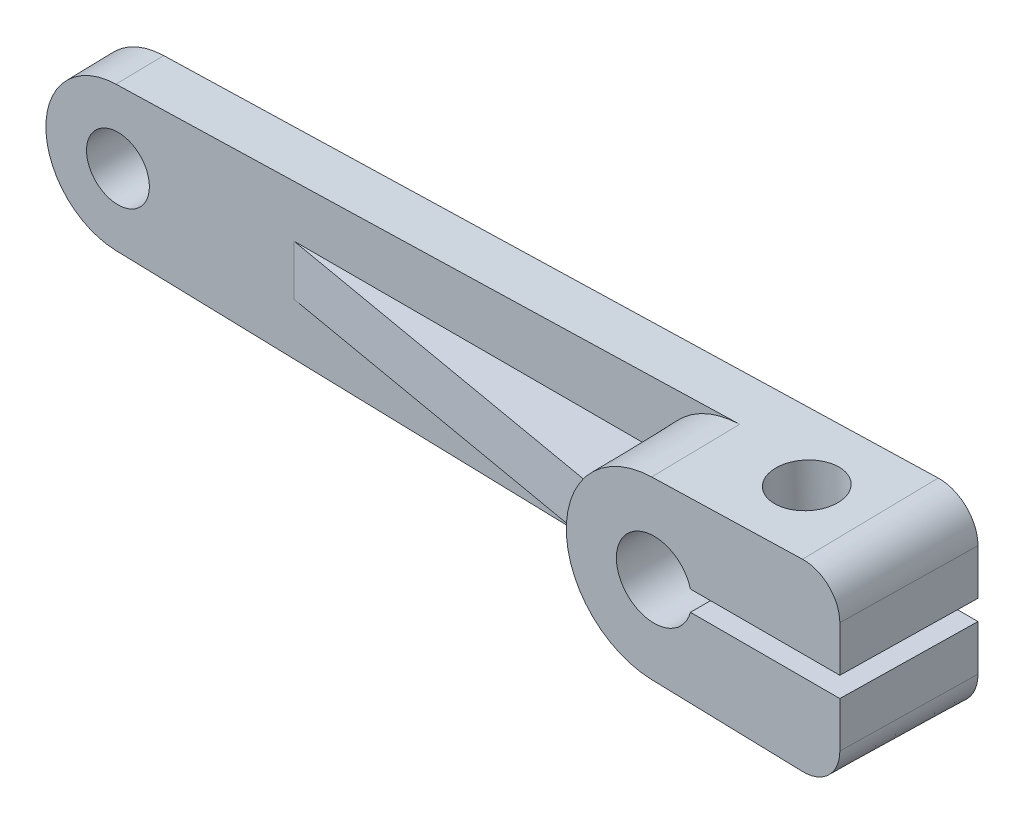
ISO-10303-21;
HEADER;
FILE_DESCRIPTION(('STEP AP214'),'2;1');
FILE_NAME('part.step','',(''),(''),'','','');
FILE_SCHEMA(('AUTOMOTIVE_DESIGN { 1 0 10303 214 1 1 1 1 }'));
ENDSEC;
DATA;
#1=APPLICATION_CONTEXT('core data for automotive mechanical design processes');
#2=APPLICATION_PROTOCOL_DEFINITION('international standard','automotive_design',2000,#1);
#3=PRODUCT_CONTEXT('',#1,'mechanical');
#4=PRODUCT('Part','Part','',(#3));
#5=PRODUCT_RELATED_PRODUCT_CATEGORY('part','',(#4));
#6=PRODUCT_DEFINITION_FORMATION('','',#4);
#7=PRODUCT_DEFINITION_CONTEXT('part definition',#1,'design');
#8=PRODUCT_DEFINITION('design','',#6,#7);
#9=PRODUCT_DEFINITION_SHAPE('','',#8);
#10=(LENGTH_UNIT() NAMED_UNIT(*) SI_UNIT(.MILLI.,.METRE.));
#11=(NAMED_UNIT(*) PLANE_ANGLE_UNIT() SI_UNIT($,.RADIAN.));
#12=(NAMED_UNIT(*) SI_UNIT($,.STERADIAN.) SOLID_ANGLE_UNIT());
#13=UNCERTAINTY_MEASURE_WITH_UNIT(LENGTH_MEASURE(1.E-05),#10,'distance_accuracy_value','');
#14=(GEOMETRIC_REPRESENTATION_CONTEXT(3) GLOBAL_UNCERTAINTY_ASSIGNED_CONTEXT((#13)) GLOBAL_UNIT_ASSIGNED_CONTEXT((#10,
#11,#12)) REPRESENTATION_CONTEXT('',''));
#15=CARTESIAN_POINT('',(0.,0.,0.));
#16=DIRECTION('',(0.,0.,1.));
#17=DIRECTION('',(1.,0.,0.));
#18=AXIS2_PLACEMENT_3D('',#15,#16,#17);
#19=CARTESIAN_POINT('',(32.3,2.21134072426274,0.));
#20=DIRECTION('',(0.999847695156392,0.,0.0174524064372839));
#21=DIRECTION('',(0.0174524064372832,0.,-0.999847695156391));
#22=AXIS2_PLACEMENT_3D('',#19,#20,#21);
#23=PLANE('',#22);
#24=DIRECTION('',(0.0174524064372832,0.,-0.999847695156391));
#25=VECTOR('',#24,1.);
#26=CARTESIAN_POINT('',(32.3,2.21134072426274,0.));
#27=LINE('',#26,#25);
#28=CARTESIAN_POINT('',(32.2057426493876,2.21134072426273,5.40000000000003));
#29=VERTEX_POINT('',#28);
#30=CARTESIAN_POINT('',(32.3,2.21134072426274,0.));
#31=VERTEX_POINT('',#30);
#32=EDGE_CURVE('E271',#29,#31,#27,.T.);
#33=ORIENTED_EDGE('',*,*,#32,.F.);
#34=DIRECTION('',(0.,-1.,0.));
#35=VECTOR('',#34,1.);
#36=CARTESIAN_POINT('',(32.2057426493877,-2.21134072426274,5.40000000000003));
#37=LINE('',#36,#35);
#38=CARTESIAN_POINT('',(32.2057426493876,0.400000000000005,5.4));
#39=VERTEX_POINT('',#38);
#40=EDGE_CURVE('E297',#39,#29,#37,.F.);
#41=ORIENTED_EDGE('',*,*,#40,.F.);
#42=DIRECTION('',(0.0174524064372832,0.,-0.999847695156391));
#43=VECTOR('',#42,1.);
#44=CARTESIAN_POINT('',(32.3,0.399999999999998,0.));
#45=LINE('',#44,#43);
#46=CARTESIAN_POINT('',(32.3,0.399999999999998,0.));
#47=VERTEX_POINT('',#46);
#48=EDGE_CURVE('E214',#39,#47,#45,.T.);
#49=ORIENTED_EDGE('',*,*,#48,.T.);
#50=DIRECTION('',(0.,-1.,0.));
#51=VECTOR('',#50,1.);
#52=CARTESIAN_POINT('',(32.3,2.21134072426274,0.));
#53=LINE('',#52,#51);
#54=EDGE_CURVE('E281',#31,#47,#53,.T.);
#55=ORIENTED_EDGE('',*,*,#54,.F.);
#56=EDGE_LOOP('',(#33,#41,#49,#55));
#57=FACE_BOUND('',#56,.T.);
#58=ADVANCED_FACE('F30',(#57),#23,.T.);
#59=CARTESIAN_POINT('',(0.,0.,0.));
#60=DIRECTION('',(0.,0.,1.));
#61=DIRECTION('',(1.,0.,0.));
#62=AXIS2_PLACEMENT_3D('',#59,#60,#61);
#63=PLANE('',#62);
#64=CARTESIAN_POINT('',(0.,0.,0.));
#65=DIRECTION('',(0.,0.,1.));
#66=DIRECTION('',(1.,0.,0.));
#67=AXIS2_PLACEMENT_3D('',#64,#65,#66);
#68=CIRCLE('',#67,1.25);
#69=CARTESIAN_POINT('',(1.25,0.,0.));
#70=VERTEX_POINT('',#69);
#71=EDGE_CURVE('E217',#70,#70,#68,.T.);
#72=ORIENTED_EDGE('',*,*,#71,.T.);
#73=EDGE_LOOP('',(#72));
#74=FACE_BOUND('',#73,.T.);
#75=ORIENTED_EDGE('',*,*,#54,.T.);
#76=DIRECTION('',(1.,0.,0.));
#77=VECTOR('',#76,1.);
#78=CARTESIAN_POINT('',(26.2649687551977,0.399999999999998,0.));
#79=LINE('',#78,#77);
#80=CARTESIAN_POINT('',(26.2649687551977,0.399999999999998,0.));
#81=VERTEX_POINT('',#80);
#82=EDGE_CURVE('E205',#81,#47,#79,.T.);
#83=ORIENTED_EDGE('',*,*,#82,.F.);
#84=CARTESIAN_POINT('',(24.8192855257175,0.,0.));
#85=DIRECTION('',(0.,0.,1.));
#86=DIRECTION('',(1.,0.,0.));
#87=AXIS2_PLACEMENT_3D('',#84,#85,#86);
#88=CIRCLE('',#87,1.5);
#89=CARTESIAN_POINT('',(26.2649687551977,-0.399999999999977,0.));
#90=VERTEX_POINT('',#89);
#91=EDGE_CURVE('E200',#81,#90,#88,.T.);
#92=ORIENTED_EDGE('',*,*,#91,.T.);
#93=DIRECTION('',(1.,0.,0.));
#94=VECTOR('',#93,1.);
#95=CARTESIAN_POINT('',(26.2649687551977,-0.399999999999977,0.));
#96=LINE('',#95,#94);
#97=CARTESIAN_POINT('',(32.3,-0.399999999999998,0.));
#98=VERTEX_POINT('',#97);
#99=EDGE_CURVE('E202',#90,#98,#96,.T.);
#100=ORIENTED_EDGE('',*,*,#99,.T.);
#101=CARTESIAN_POINT('',(32.3,-2.21134072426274,0.));
#102=VERTEX_POINT('',#101);
#103=EDGE_CURVE('E283',#98,#102,#53,.T.);
#104=ORIENTED_EDGE('',*,*,#103,.T.);
#105=CARTESIAN_POINT('',(30.7607533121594,-2.21134072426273,0.));
#106=DIRECTION('',(0.,0.,1.));
#107=DIRECTION('',(1.,0.,0.));
#108=AXIS2_PLACEMENT_3D('',#105,#106,#107);
#109=CIRCLE('',#108,1.53924668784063);
#110=CARTESIAN_POINT('',(30.7182327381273,-3.75,0.));
#111=VERTEX_POINT('',#110);
#112=EDGE_CURVE('E284',#111,#102,#109,.T.);
#113=ORIENTED_EDGE('',*,*,#112,.F.);
#114=DIRECTION('',(0.999618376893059,-0.0276242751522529,0.));
#115=VECTOR('',#114,1.);
#116=CARTESIAN_POINT('',(-0.0801103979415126,-2.89889329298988,0.));
#117=LINE('',#116,#115);
#118=CARTESIAN_POINT('',(-0.0801103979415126,-2.89889329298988,0.));
#119=VERTEX_POINT('',#118);
#120=EDGE_CURVE('E240',#119,#111,#117,.T.);
#121=ORIENTED_EDGE('',*,*,#120,.F.);
#122=CARTESIAN_POINT('',(0.,0.,0.));
#123=DIRECTION('',(0.,0.,1.));
#124=DIRECTION('',(1.,0.,0.));
#125=AXIS2_PLACEMENT_3D('',#122,#123,#124);
#126=CIRCLE('',#125,2.9);
#127=CARTESIAN_POINT('',(-0.0801103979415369,2.89889329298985,0.));
#128=VERTEX_POINT('',#127);
#129=EDGE_CURVE('E237',#128,#119,#126,.T.);
#130=ORIENTED_EDGE('',*,*,#129,.F.);
#131=DIRECTION('',(0.999618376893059,0.027624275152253,0.));
#132=VECTOR('',#131,1.);
#133=CARTESIAN_POINT('',(-0.0801103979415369,2.89889329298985,0.));
#134=LINE('',#133,#132);
#135=CARTESIAN_POINT('',(30.7182327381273,3.75,0.));
#136=VERTEX_POINT('',#135);
#137=EDGE_CURVE('E266',#128,#136,#134,.T.);
#138=ORIENTED_EDGE('',*,*,#137,.T.);
#139=CARTESIAN_POINT('',(30.7607533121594,2.21134072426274,0.));
#140=DIRECTION('',(0.,0.,-1.));
#141=DIRECTION('',(-1.,0.,0.));
#142=AXIS2_PLACEMENT_3D('',#139,#140,#141);
#143=CIRCLE('',#142,1.53924668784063);
#144=EDGE_CURVE('E278',#136,#31,#143,.T.);
#145=ORIENTED_EDGE('',*,*,#144,.T.);
#146=EDGE_LOOP('',(#75,#83,#92,#100,#104,#113,#121,#130,#138,#145));
#147=FACE_BOUND('',#146,.T.);
#148=ADVANCED_FACE('F328',(#74,#147),#63,.F.);
#149=CARTESIAN_POINT('',(30.7607533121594,-2.21134072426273,5.40000000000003));
#150=DIRECTION('',(0.,0.,1.));
#151=DIRECTION('',(1.,0.,0.));
#152=AXIS2_PLACEMENT_3D('',#149,#150,#151);
#153=PLANE('',#152);
#154=DIRECTION('',(1.,0.,0.));
#155=VECTOR('',#154,1.);
#156=CARTESIAN_POINT('',(26.2649687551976,0.400000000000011,5.4));
#157=LINE('',#156,#155);
#158=CARTESIAN_POINT('',(26.2649687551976,0.400000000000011,5.4));
#159=VERTEX_POINT('',#158);
#160=EDGE_CURVE('E198',#159,#39,#157,.T.);
#161=ORIENTED_EDGE('',*,*,#160,.T.);
#162=ORIENTED_EDGE('',*,*,#40,.T.);
#163=CARTESIAN_POINT('',(30.7607533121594,2.21134072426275,5.4));
#164=DIRECTION('',(0.,0.,1.));
#165=DIRECTION('',(1.,0.,0.));
#166=AXIS2_PLACEMENT_3D('',#163,#164,#165);
#167=CIRCLE('',#166,1.44498933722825);
#168=CARTESIAN_POINT('',(30.7208365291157,3.65577862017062,5.40000000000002));
#169=VERTEX_POINT('',#168);
#170=EDGE_CURVE('E294',#29,#169,#167,.T.);
#171=ORIENTED_EDGE('',*,*,#170,.T.);
#172=DIRECTION('',(0.999618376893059,0.0276242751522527,0.));
#173=VECTOR('',#172,1.);
#174=CARTESIAN_POINT('',(30.7208365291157,3.65577862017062,5.40000000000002));
#175=LINE('',#174,#173);
#176=CARTESIAN_POINT('',(24.722839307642,3.49002503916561,5.4));
#177=VERTEX_POINT('',#176);
#178=EDGE_CURVE('E291',#169,#177,#175,.F.);
#179=ORIENTED_EDGE('',*,*,#178,.T.);
#180=CARTESIAN_POINT('',(24.8192855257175,0.,5.4));
#181=DIRECTION('',(0.,0.,1.));
#182=DIRECTION('',(1.,0.,0.));
#183=AXIS2_PLACEMENT_3D('',#180,#181,#182);
#184=CIRCLE('',#183,3.49135742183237);
#185=CARTESIAN_POINT('',(24.722839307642,-3.49002503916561,5.40000000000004));
#186=VERTEX_POINT('',#185);
#187=EDGE_CURVE('E249',#177,#186,#184,.T.);
#188=ORIENTED_EDGE('',*,*,#187,.T.);
#189=DIRECTION('',(-0.999618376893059,0.0276242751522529,0.));
#190=VECTOR('',#189,1.);
#191=CARTESIAN_POINT('',(24.722839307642,-3.49002503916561,5.40000000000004));
#192=LINE('',#191,#190);
#193=CARTESIAN_POINT('',(30.7208365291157,-3.65577862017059,5.40000000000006));
#194=VERTEX_POINT('',#193);
#195=EDGE_CURVE('E243',#186,#194,#192,.F.);
#196=ORIENTED_EDGE('',*,*,#195,.T.);
#197=CARTESIAN_POINT('',(30.7607533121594,-2.21134072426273,5.40000000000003));
#198=DIRECTION('',(0.,0.,1.));
#199=DIRECTION('',(1.,0.,0.));
#200=AXIS2_PLACEMENT_3D('',#197,#198,#199);
#201=CIRCLE('',#200,1.44498933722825);
#202=CARTESIAN_POINT('',(32.2057426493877,-2.21134072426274,5.40000000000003));
#203=VERTEX_POINT('',#202);
#204=EDGE_CURVE('E226',#194,#203,#201,.T.);
#205=ORIENTED_EDGE('',*,*,#204,.T.);
#206=CARTESIAN_POINT('',(32.2057426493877,-0.399999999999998,5.40000000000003));
#207=VERTEX_POINT('',#206);
#208=EDGE_CURVE('E296',#203,#207,#37,.F.);
#209=ORIENTED_EDGE('',*,*,#208,.T.);
#210=DIRECTION('',(1.,0.,0.));
#211=VECTOR('',#210,1.);
#212=CARTESIAN_POINT('',(26.2649687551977,-0.400000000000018,5.40000000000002));
#213=LINE('',#212,#211);
#214=CARTESIAN_POINT('',(26.2649687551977,-0.400000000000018,5.40000000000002));
#215=VERTEX_POINT('',#214);
#216=EDGE_CURVE('E195',#215,#207,#213,.T.);
#217=ORIENTED_EDGE('',*,*,#216,.F.);
#218=CARTESIAN_POINT('',(24.8192855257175,0.,5.4));
#219=DIRECTION('',(0.,0.,1.));
#220=DIRECTION('',(1.,0.,0.));
#221=AXIS2_PLACEMENT_3D('',#218,#219,#220);
#222=CIRCLE('',#221,1.5);
#223=EDGE_CURVE('E192',#159,#215,#222,.T.);
#224=ORIENTED_EDGE('',*,*,#223,.F.);
#225=EDGE_LOOP('',(#161,#162,#171,#179,#188,#196,#205,#209,#217,#224));
#226=FACE_BOUND('',#225,.T.);
#227=ADVANCED_FACE('F335',(#226),#153,.T.);
#228=CARTESIAN_POINT('',(0.,0.,0.));
#229=DIRECTION('',(0.,0.,-1.));
#230=DIRECTION('',(1.,0.,0.));
#231=AXIS2_PLACEMENT_3D('',#228,#229,#230);
#232=CONICAL_SURFACE('',#231,2.9,0.0174532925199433);
#233=ORIENTED_EDGE('',*,*,#129,.T.);
#234=DIRECTION('',(-0.000482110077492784,-0.0174457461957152,-0.999847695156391));
#235=VECTOR('',#234,1.);
#236=CARTESIAN_POINT('',(-0.0801103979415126,-2.89889329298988,0.));
#237=LINE('',#236,#235);
#238=CARTESIAN_POINT('',(-0.0791942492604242,-2.86574132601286,1.9));
#239=VERTEX_POINT('',#238);
#240=EDGE_CURVE('E11',#239,#119,#237,.T.);
#241=ORIENTED_EDGE('',*,*,#240,.F.);
#242=CARTESIAN_POINT('',(0.,0.,1.90000000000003));
#243=DIRECTION('',(0.,0.,1.));
#244=DIRECTION('',(1.,0.,0.));
#245=AXIS2_PLACEMENT_3D('',#242,#243,#244);
#246=CIRCLE('',#245,2.86683537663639);
#247=CARTESIAN_POINT('',(-0.079194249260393,2.86574132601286,1.9));
#248=VERTEX_POINT('',#247);
#249=EDGE_CURVE('E263',#248,#239,#246,.T.);
#250=ORIENTED_EDGE('',*,*,#249,.F.);
#251=DIRECTION('',(-0.000482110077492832,0.0174457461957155,-0.999847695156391));
#252=VECTOR('',#251,1.);
#253=CARTESIAN_POINT('',(-0.0801103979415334,2.89889329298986,0.));
#254=LINE('',#253,#252);
#255=EDGE_CURVE('E257',#248,#128,#254,.T.);
#256=ORIENTED_EDGE('',*,*,#255,.T.);
#257=EDGE_LOOP('',(#233,#241,#250,#256));
#258=FACE_BOUND('',#257,.T.);
#259=ADVANCED_FACE('F361',(#258),#232,.T.);
#260=CARTESIAN_POINT('',(-0.0801103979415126,-2.89889329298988,0.));
#261=DIRECTION('',(-0.0276200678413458,-0.999466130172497,0.0174524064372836));
#262=DIRECTION('',(0.999618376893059,-0.0276242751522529,0.));
#263=AXIS2_PLACEMENT_3D('',#260,#261,#262);
#264=PLANE('',#263);
#265=CARTESIAN_POINT('',(28.4409052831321,-3.6412721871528,2.62255109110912));
#266=DIRECTION('',(-0.0276200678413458,-0.999466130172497,0.0174524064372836));
#267=DIRECTION('',(-0.844924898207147,0.0326719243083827,0.53388618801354));
#268=AXIS2_PLACEMENT_3D('',#265,#266,#267);
#269=ELLIPSE('',#268,1.25267434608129,1.25);
#270=CARTESIAN_POINT('',(27.3824895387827,-3.60034490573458,3.29133662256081));
#271=VERTEX_POINT('',#270);
#272=EDGE_CURVE('E156',#271,#271,#269,.F.);
#273=ORIENTED_EDGE('',*,*,#272,.T.);
#274=EDGE_LOOP('',(#273));
#275=FACE_BOUND('',#274,.T.);
#276=DIRECTION('',(-0.00048211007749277,-0.0174457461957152,-0.999847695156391));
#277=VECTOR('',#276,1.);
#278=CARTESIAN_POINT('',(30.7182327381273,-3.75,0.));
#279=LINE('',#278,#277);
#280=EDGE_CURVE('E39',#194,#111,#279,.T.);
#281=ORIENTED_EDGE('',*,*,#280,.F.);
#282=ORIENTED_EDGE('',*,*,#195,.F.);
#283=DIRECTION('',(-0.000482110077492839,-0.0174457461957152,-0.999847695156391));
#284=VECTOR('',#283,1.);
#285=CARTESIAN_POINT('',(24.7211516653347,-3.55109445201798,1.90000000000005));
#286=LINE('',#285,#284);
#287=CARTESIAN_POINT('',(24.7211516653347,-3.55109445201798,1.90000000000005));
#288=VERTEX_POINT('',#287);
#289=EDGE_CURVE('E238',#186,#288,#286,.T.);
#290=ORIENTED_EDGE('',*,*,#289,.T.);
#291=DIRECTION('',(-0.999618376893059,0.0276242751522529,0.));
#292=VECTOR('',#291,1.);
#293=CARTESIAN_POINT('',(-0.0791942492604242,-2.86574132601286,1.9));
#294=LINE('',#293,#292);
#295=EDGE_CURVE('E258',#239,#288,#294,.F.);
#296=ORIENTED_EDGE('',*,*,#295,.F.);
#297=ORIENTED_EDGE('',*,*,#240,.T.);
#298=ORIENTED_EDGE('',*,*,#120,.T.);
#299=EDGE_LOOP('',(#281,#282,#290,#296,#297,#298));
#300=FACE_BOUND('',#299,.T.);
#301=ADVANCED_FACE('F32',(#275,#300),#264,.T.);
#302=CARTESIAN_POINT('',(30.7607533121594,-2.21134072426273,0.));
#303=DIRECTION('',(0.,0.,-1.));
#304=DIRECTION('',(1.,0.,0.));
#305=AXIS2_PLACEMENT_3D('',#302,#303,#304);
#306=CONICAL_SURFACE('',#305,1.53924668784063,0.0174532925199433);
#307=DIRECTION('',(0.0174524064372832,0.,-0.999847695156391));
#308=VECTOR('',#307,1.);
#309=CARTESIAN_POINT('',(32.3,-2.21134072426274,0.));
#310=LINE('',#309,#308);
#311=EDGE_CURVE('E268',#203,#102,#310,.T.);
#312=ORIENTED_EDGE('',*,*,#311,.F.);
#313=ORIENTED_EDGE('',*,*,#204,.F.);
#314=ORIENTED_EDGE('',*,*,#280,.T.);
#315=ORIENTED_EDGE('',*,*,#112,.T.);
#316=EDGE_LOOP('',(#312,#313,#314,#315));
#317=FACE_BOUND('',#316,.T.);
#318=ADVANCED_FACE('F339',(#317),#306,.T.);
#319=DIRECTION('',(0.0174524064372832,0.,-0.999847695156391));
#320=VECTOR('',#319,1.);
#321=CARTESIAN_POINT('',(32.3,-0.399999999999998,0.));
#322=LINE('',#321,#320);
#323=EDGE_CURVE('E212',#207,#98,#322,.T.);
#324=ORIENTED_EDGE('',*,*,#323,.F.);
#325=ORIENTED_EDGE('',*,*,#208,.F.);
#326=ORIENTED_EDGE('',*,*,#311,.T.);
#327=ORIENTED_EDGE('',*,*,#103,.F.);
#328=EDGE_LOOP('',(#324,#325,#326,#327));
#329=FACE_BOUND('',#328,.T.);
#330=ADVANCED_FACE('F331',(#329),#23,.T.);
#331=CARTESIAN_POINT('',(30.7607533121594,2.21134072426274,0.));
#332=DIRECTION('',(0.,0.,-1.));
#333=DIRECTION('',(-1.,0.,0.));
#334=AXIS2_PLACEMENT_3D('',#331,#332,#333);
#335=CONICAL_SURFACE('',#334,1.53924668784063,0.0174532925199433);
#336=DIRECTION('',(-0.000482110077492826,0.0174457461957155,-0.999847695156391));
#337=VECTOR('',#336,1.);
#338=CARTESIAN_POINT('',(30.7182327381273,3.75,0.));
#339=LINE('',#338,#337);
#340=EDGE_CURVE('E273',#169,#136,#339,.T.);
#341=ORIENTED_EDGE('',*,*,#340,.F.);
#342=ORIENTED_EDGE('',*,*,#170,.F.);
#343=ORIENTED_EDGE('',*,*,#32,.T.);
#344=ORIENTED_EDGE('',*,*,#144,.F.);
#345=EDGE_LOOP('',(#341,#342,#343,#344));
#346=FACE_BOUND('',#345,.T.);
#347=ADVANCED_FACE('F311',(#346),#335,.T.);
#348=CARTESIAN_POINT('',(-0.0801103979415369,2.89889329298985,0.));
#349=DIRECTION('',(-0.0276200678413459,0.999466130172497,0.0174524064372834));
#350=DIRECTION('',(-0.999618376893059,-0.027624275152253,0.));
#351=AXIS2_PLACEMENT_3D('',#348,#349,#350);
#352=PLANE('',#351);
#353=CARTESIAN_POINT('',(28.2398682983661,3.63349840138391,2.7495811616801));
#354=DIRECTION('',(-0.0276200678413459,0.999466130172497,0.0174524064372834));
#355=DIRECTION('',(-0.999618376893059,-0.027624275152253,0.));
#356=AXIS2_PLACEMENT_3D('',#353,#354,#355);
#357=CIRCLE('',#356,1.25);
#358=CARTESIAN_POINT('',(26.9903453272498,3.59896805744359,2.7495811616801));
#359=VERTEX_POINT('',#358);
#360=EDGE_CURVE('E379',#359,#359,#357,.T.);
#361=ORIENTED_EDGE('',*,*,#360,.F.);
#362=EDGE_LOOP('',(#361));
#363=FACE_BOUND('',#362,.T.);
#364=DIRECTION('',(0.999618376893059,0.027624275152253,0.));
#365=VECTOR('',#364,1.);
#366=CARTESIAN_POINT('',(-0.079194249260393,2.86574132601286,1.9));
#367=LINE('',#366,#365);
#368=CARTESIAN_POINT('',(24.7211516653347,3.551094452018,1.9));
#369=VERTEX_POINT('',#368);
#370=EDGE_CURVE('E252',#248,#369,#367,.T.);
#371=ORIENTED_EDGE('',*,*,#370,.T.);
#372=DIRECTION('',(-0.000482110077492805,0.0174457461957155,-0.999847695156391));
#373=VECTOR('',#372,1.);
#374=CARTESIAN_POINT('',(24.7211516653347,3.551094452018,1.9));
#375=LINE('',#374,#373);
#376=EDGE_CURVE('E235',#177,#369,#375,.T.);
#377=ORIENTED_EDGE('',*,*,#376,.F.);
#378=ORIENTED_EDGE('',*,*,#178,.F.);
#379=ORIENTED_EDGE('',*,*,#340,.T.);
#380=ORIENTED_EDGE('',*,*,#137,.F.);
#381=ORIENTED_EDGE('',*,*,#255,.F.);
#382=EDGE_LOOP('',(#371,#377,#378,#379,#380,#381));
#383=FACE_BOUND('',#382,.T.);
#384=ADVANCED_FACE('F309',(#363,#383),#352,.T.);
#385=CARTESIAN_POINT('',(0.,0.,1.90000000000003));
#386=DIRECTION('',(0.,0.,1.));
#387=DIRECTION('',(1.,0.,0.));
#388=AXIS2_PLACEMENT_3D('',#385,#386,#387);
#389=PLANE('',#388);
#390=DIRECTION('',(-1.,0.,0.));
#391=VECTOR('',#390,1.);
#392=CARTESIAN_POINT('',(0.,1.00000000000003,1.9));
#393=LINE('',#392,#391);
#394=CARTESIAN_POINT('',(21.4104877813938,1.,1.90000000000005));
#395=VERTEX_POINT('',#394);
#396=CARTESIAN_POINT('',(7.00000000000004,0.999999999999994,1.9));
#397=VERTEX_POINT('',#396);
#398=EDGE_CURVE('E190',#395,#397,#393,.T.);
#399=ORIENTED_EDGE('',*,*,#398,.F.);
#400=CARTESIAN_POINT('',(24.8192855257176,0.,1.9));
#401=DIRECTION('',(0.,0.,1.));
#402=DIRECTION('',(1.,0.,0.));
#403=AXIS2_PLACEMENT_3D('',#400,#401,#402);
#404=CIRCLE('',#403,3.55245014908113);
#405=EDGE_CURVE('E230',#369,#395,#404,.T.);
#406=ORIENTED_EDGE('',*,*,#405,.F.);
#407=ORIENTED_EDGE('',*,*,#370,.F.);
#408=ORIENTED_EDGE('',*,*,#249,.T.);
#409=ORIENTED_EDGE('',*,*,#295,.T.);
#410=CARTESIAN_POINT('',(21.4104877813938,-1.,1.90000000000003));
#411=VERTEX_POINT('',#410);
#412=EDGE_CURVE('E223',#411,#288,#404,.T.);
#413=ORIENTED_EDGE('',*,*,#412,.F.);
#414=DIRECTION('',(-1.,0.,0.));
#415=VECTOR('',#414,1.);
#416=CARTESIAN_POINT('',(0.,-1.,1.9));
#417=LINE('',#416,#415);
#418=CARTESIAN_POINT('',(7.00000000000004,-1.,1.90000000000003));
#419=VERTEX_POINT('',#418);
#420=EDGE_CURVE('E52',#411,#419,#417,.T.);
#421=ORIENTED_EDGE('',*,*,#420,.T.);
#422=DIRECTION('',(0.,-1.,0.));
#423=VECTOR('',#422,1.);
#424=CARTESIAN_POINT('',(7.00000000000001,0.,1.9));
#425=LINE('',#424,#423);
#426=EDGE_CURVE('E47',#397,#419,#425,.T.);
#427=ORIENTED_EDGE('',*,*,#426,.F.);
#428=EDGE_LOOP('',(#399,#406,#407,#408,#409,#413,#421,#427));
#429=FACE_BOUND('',#428,.T.);
#430=CARTESIAN_POINT('',(0.,0.,1.90000000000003));
#431=DIRECTION('',(0.,0.,1.));
#432=DIRECTION('',(1.,0.,0.));
#433=AXIS2_PLACEMENT_3D('',#430,#431,#432);
#434=CIRCLE('',#433,1.25);
#435=CARTESIAN_POINT('',(1.25,0.,1.90000000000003));
#436=VERTEX_POINT('',#435);
#437=EDGE_CURVE('E220',#436,#436,#434,.T.);
#438=ORIENTED_EDGE('',*,*,#437,.F.);
#439=EDGE_LOOP('',(#438));
#440=FACE_BOUND('',#439,.T.);
#441=ADVANCED_FACE('F306',(#429,#440),#389,.T.);
#442=CARTESIAN_POINT('',(24.8192855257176,0.,1.9));
#443=DIRECTION('',(0.,0.,-1.));
#444=DIRECTION('',(1.,0.,0.));
#445=AXIS2_PLACEMENT_3D('',#442,#443,#444);
#446=CONICAL_SURFACE('',#445,3.55245014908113,0.0174532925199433);
#447=ORIENTED_EDGE('',*,*,#405,.T.);
#448=CARTESIAN_POINT('',(21.2883256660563,1.00000000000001,-4.82488464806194));
#449=CARTESIAN_POINT('',(21.3316639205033,1.00000000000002,-2.43572317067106));
#450=CARTESIAN_POINT('',(21.3750685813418,1.00000000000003,-0.0465629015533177));
#451=CARTESIAN_POINT('',(21.4620107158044,1.00000000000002,4.73175522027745));
#452=CARTESIAN_POINT('',(21.5055481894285,1.00000000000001,7.12091307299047));
#453=CARTESIAN_POINT('',(21.5491520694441,0.999999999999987,9.51006971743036));
#454=B_SPLINE_CURVE_WITH_KNOTS('',3,(#448,#449,#450,#451,#452,#453),.UNSPECIFIED.,.F.,.F.,(4,2,
4),(0.,7.16866352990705,14.3373270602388),.UNSPECIFIED.);
#455=CARTESIAN_POINT('',(21.4564531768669,1.00000000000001,4.42550232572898));
#456=VERTEX_POINT('',#455);
#457=EDGE_CURVE('E143',#395,#456,#454,.T.);
#458=ORIENTED_EDGE('',*,*,#457,.T.);
#459=CARTESIAN_POINT('',(24.8086184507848,0.,5.01111631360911));
#460=DIRECTION('',(-0.172090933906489,0.,0.985081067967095));
#461=DIRECTION('',(-0.985081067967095,0.,-0.17209093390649));
#462=AXIS2_PLACEMENT_3D('',#459,#460,#461);
#463=ELLIPSE('',#462,3.55112439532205,3.49812914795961);
#464=CARTESIAN_POINT('',(21.4564531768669,-0.999999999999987,4.42550232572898));
#465=VERTEX_POINT('',#464);
#466=EDGE_CURVE('E137',#456,#465,#463,.T.);
#467=ORIENTED_EDGE('',*,*,#466,.T.);
#468=CARTESIAN_POINT('',(21.2883256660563,-1.,-4.82488464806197));
#469=CARTESIAN_POINT('',(21.3316639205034,-0.999999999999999,-2.43572317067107));
#470=CARTESIAN_POINT('',(21.3750685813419,-0.999999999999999,-0.0465629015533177));
#471=CARTESIAN_POINT('',(21.4620107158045,-1.,4.73175522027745));
#472=CARTESIAN_POINT('',(21.5055481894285,-1.00000000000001,7.12091307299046));
#473=CARTESIAN_POINT('',(21.5491520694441,-1.00000000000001,9.51006971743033));
#474=B_SPLINE_CURVE_WITH_KNOTS('',3,(#468,#469,#470,#471,#472,#473),.UNSPECIFIED.,.F.,.F.,(4,2,
4),(0.,7.1686635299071,14.3373270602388),.UNSPECIFIED.);
#475=EDGE_CURVE('E141',#411,#465,#474,.T.);
#476=ORIENTED_EDGE('',*,*,#475,.F.);
#477=ORIENTED_EDGE('',*,*,#412,.T.);
#478=ORIENTED_EDGE('',*,*,#289,.F.);
#479=ORIENTED_EDGE('',*,*,#187,.F.);
#480=ORIENTED_EDGE('',*,*,#376,.T.);
#481=EDGE_LOOP('',(#447,#458,#467,#476,#477,#478,#479,#480));
#482=FACE_BOUND('',#481,.T.);
#483=ADVANCED_FACE('F140',(#482),#446,.T.);
#484=CARTESIAN_POINT('',(0.,0.,0.));
#485=DIRECTION('',(0.,0.,1.));
#486=DIRECTION('',(1.,0.,0.));
#487=AXIS2_PLACEMENT_3D('',#484,#485,#486);
#488=CYLINDRICAL_SURFACE('',#487,1.25);
#489=CARTESIAN_POINT('',(1.25,0.,0.));
#490=CARTESIAN_POINT('',(1.25,0.,0.0197916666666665));
#491=CARTESIAN_POINT('',(1.25,0.,0.0395833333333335));
#492=CARTESIAN_POINT('',(1.25,0.,0.0791666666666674));
#493=CARTESIAN_POINT('',(1.25,0.,0.0989583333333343));
#494=CARTESIAN_POINT('',(1.25,0.,0.138541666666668));
#495=CARTESIAN_POINT('',(1.25,0.,0.158333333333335));
#496=CARTESIAN_POINT('',(1.25,0.,0.197916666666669));
#497=CARTESIAN_POINT('',(1.25,0.,0.217708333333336));
#498=CARTESIAN_POINT('',(1.25,0.,0.25729166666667));
#499=CARTESIAN_POINT('',(1.25,0.,0.277083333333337));
#500=CARTESIAN_POINT('',(1.25,0.,0.316666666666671));
#501=CARTESIAN_POINT('',(1.25,0.,0.336458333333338));
#502=CARTESIAN_POINT('',(1.25,0.,0.376041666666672));
#503=CARTESIAN_POINT('',(1.25,0.,0.395833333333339));
#504=CARTESIAN_POINT('',(1.25,0.,0.435416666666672));
#505=CARTESIAN_POINT('',(1.25,0.,0.455208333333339));
#506=CARTESIAN_POINT('',(1.25,0.,0.494791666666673));
#507=CARTESIAN_POINT('',(1.25,0.,0.51458333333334));
#508=CARTESIAN_POINT('',(1.25,0.,0.554166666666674));
#509=CARTESIAN_POINT('',(1.25,0.,0.573958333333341));
#510=CARTESIAN_POINT('',(1.25,0.,0.613541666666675));
#511=CARTESIAN_POINT('',(1.25,0.,0.633333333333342));
#512=CARTESIAN_POINT('',(1.25,0.,0.672916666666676));
#513=CARTESIAN_POINT('',(1.25,0.,0.692708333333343));
#514=CARTESIAN_POINT('',(1.25,0.,0.732291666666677));
#515=CARTESIAN_POINT('',(1.25,0.,0.752083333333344));
#516=CARTESIAN_POINT('',(1.25,0.,0.791666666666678));
#517=CARTESIAN_POINT('',(1.25,0.,0.811458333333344));
#518=CARTESIAN_POINT('',(1.25,0.,0.851041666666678));
#519=CARTESIAN_POINT('',(1.25,0.,0.870833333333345));
#520=CARTESIAN_POINT('',(1.25,0.,0.910416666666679));
#521=CARTESIAN_POINT('',(1.25,0.,0.930208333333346));
#522=CARTESIAN_POINT('',(1.25,0.,0.96979166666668));
#523=CARTESIAN_POINT('',(1.25,0.,0.989583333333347));
#524=CARTESIAN_POINT('',(1.25,0.,1.02916666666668));
#525=CARTESIAN_POINT('',(1.25,0.,1.04895833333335));
#526=CARTESIAN_POINT('',(1.25,0.,1.08854166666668));
#527=CARTESIAN_POINT('',(1.25,0.,1.10833333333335));
#528=CARTESIAN_POINT('',(1.25,0.,1.14791666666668));
#529=CARTESIAN_POINT('',(1.25,0.,1.16770833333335));
#530=CARTESIAN_POINT('',(1.25,0.,1.20729166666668));
#531=CARTESIAN_POINT('',(1.25,0.,1.22708333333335));
#532=CARTESIAN_POINT('',(1.25,0.,1.26666666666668));
#533=CARTESIAN_POINT('',(1.25,0.,1.28645833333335));
#534=CARTESIAN_POINT('',(1.25,0.,1.32604166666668));
#535=CARTESIAN_POINT('',(1.25,0.,1.34583333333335));
#536=CARTESIAN_POINT('',(1.25,0.,1.38541666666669));
#537=CARTESIAN_POINT('',(1.25,0.,1.40520833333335));
#538=CARTESIAN_POINT('',(1.25,0.,1.44479166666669));
#539=CARTESIAN_POINT('',(1.25,0.,1.46458333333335));
#540=CARTESIAN_POINT('',(1.25,0.,1.50416666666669));
#541=CARTESIAN_POINT('',(1.25,0.,1.52395833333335));
#542=CARTESIAN_POINT('',(1.25,0.,1.56354166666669));
#543=CARTESIAN_POINT('',(1.25,0.,1.58333333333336));
#544=CARTESIAN_POINT('',(1.25,0.,1.62291666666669));
#545=CARTESIAN_POINT('',(1.25,0.,1.64270833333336));
#546=CARTESIAN_POINT('',(1.25,0.,1.68229166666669));
#547=CARTESIAN_POINT('',(1.25,0.,1.70208333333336));
#548=CARTESIAN_POINT('',(1.25,0.,1.74166666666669));
#549=CARTESIAN_POINT('',(1.25,0.,1.76145833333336));
#550=CARTESIAN_POINT('',(1.25,0.,1.80104166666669));
#551=CARTESIAN_POINT('',(1.25,0.,1.82083333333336));
#552=CARTESIAN_POINT('',(1.25,0.,1.86041666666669));
#553=CARTESIAN_POINT('',(1.25,0.,1.88020833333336));
#554=CARTESIAN_POINT('',(1.25,0.,1.90000000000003));
#555=B_SPLINE_CURVE_WITH_KNOTS('',3,(#489,#490,#491,#492,#493,#494,#495,#496,#497,#498,#499,
#500,#501,#502,#503,#504,#505,#506,#507,#508,#509,#510,#511,#512,#513,#514,#515,#516,#517,#518,
#519,#520,#521,#522,#523,#524,#525,#526,#527,#528,#529,#530,#531,#532,#533,#534,#535,#536,#537,
#538,#539,#540,#541,#542,#543,#544,#545,#546,#547,#548,#549,#550,#551,#552,#553,#554),
.UNSPECIFIED.,.F.,.F.,(4,2,2,2,2,2,2,2,2,2,2,2,2,2,2,2,2,2,2,2,2,2,2,2,2,2,2,2,2,2,2,2,4),(0.,
0.0593750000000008,0.118750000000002,0.178125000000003,0.237500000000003,0.296875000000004,
0.356250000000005,0.415625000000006,0.475000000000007,0.534375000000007,0.593750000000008,
0.653125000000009,0.71250000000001,0.771875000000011,0.831250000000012,0.890625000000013,
0.950000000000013,1.00937500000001,1.06875000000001,1.12812500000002,1.18750000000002,
1.24687500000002,1.30625000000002,1.36562500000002,1.42500000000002,1.48437500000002,
1.54375000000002,1.60312500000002,1.66250000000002,1.72187500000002,1.78125000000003,
1.84062500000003,1.90000000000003),.UNSPECIFIED.);
#556=EDGE_CURVE('BSEAM314',#70,#436,#555,.T.);
#557=ORIENTED_EDGE('',*,*,#71,.F.);
#558=ORIENTED_EDGE('',*,*,#437,.T.);
#559=ORIENTED_EDGE('',*,*,#556,.T.);
#560=ORIENTED_EDGE('',*,*,#556,.F.);
#561=EDGE_LOOP('',(#557,#559,#558,#560));
#562=FACE_BOUND('',#561,.T.);
#563=ADVANCED_FACE('F314',(#562),#488,.F.);
#564=CARTESIAN_POINT('',(24.8192855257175,0.,0.));
#565=DIRECTION('',(0.,0.,1.));
#566=DIRECTION('',(1.,0.,0.));
#567=AXIS2_PLACEMENT_3D('',#564,#565,#566);
#568=CYLINDRICAL_SURFACE('',#567,1.5);
#569=DIRECTION('',(0.,0.,1.));
#570=VECTOR('',#569,1.);
#571=CARTESIAN_POINT('',(26.2649687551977,0.399999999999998,0.));
#572=LINE('',#571,#570);
#573=EDGE_CURVE('E210',#81,#159,#572,.T.);
#574=ORIENTED_EDGE('',*,*,#573,.T.);
#575=ORIENTED_EDGE('',*,*,#223,.T.);
#576=DIRECTION('',(0.,0.,1.));
#577=VECTOR('',#576,1.);
#578=CARTESIAN_POINT('',(26.2649687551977,-0.399999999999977,0.));
#579=LINE('',#578,#577);
#580=EDGE_CURVE('E208',#90,#215,#579,.T.);
#581=ORIENTED_EDGE('',*,*,#580,.F.);
#582=ORIENTED_EDGE('',*,*,#91,.F.);
#583=EDGE_LOOP('',(#574,#575,#581,#582));
#584=FACE_BOUND('',#583,.T.);
#585=ADVANCED_FACE('F316',(#584),#568,.F.);
#586=CARTESIAN_POINT('',(26.2649687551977,0.399999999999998,0.));
#587=DIRECTION('',(0.,-1.,0.));
#588=DIRECTION('',(1.,0.,0.));
#589=AXIS2_PLACEMENT_3D('',#586,#587,#588);
#590=PLANE('',#589);
#591=CARTESIAN_POINT('',(28.3292254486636,0.400000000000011,2.69311868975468));
#592=DIRECTION('',(0.,-1.,0.));
#593=DIRECTION('',(-0.845376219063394,0.,0.534171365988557));
#594=AXIS2_PLACEMENT_3D('',#591,#592,#593);
#595=ELLIPSE('',#594,1.25066769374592,1.25);
#596=CARTESIAN_POINT('',(27.27194072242,0.400000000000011,3.3611895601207));
#597=VERTEX_POINT('',#596);
#598=EDGE_CURVE('E160',#597,#597,#595,.T.);
#599=ORIENTED_EDGE('',*,*,#598,.F.);
#600=EDGE_LOOP('',(#599));
#601=FACE_BOUND('',#600,.T.);
#602=ORIENTED_EDGE('',*,*,#160,.F.);
#603=ORIENTED_EDGE('',*,*,#573,.F.);
#604=ORIENTED_EDGE('',*,*,#82,.T.);
#605=ORIENTED_EDGE('',*,*,#48,.F.);
#606=EDGE_LOOP('',(#602,#603,#604,#605));
#607=FACE_BOUND('',#606,.T.);
#608=ADVANCED_FACE('F323',(#601,#607),#590,.T.);
#609=CARTESIAN_POINT('',(26.2649687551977,-0.399999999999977,0.));
#610=DIRECTION('',(0.,-1.,0.));
#611=DIRECTION('',(1.,0.,0.));
#612=AXIS2_PLACEMENT_3D('',#609,#610,#611);
#613=PLANE('',#612);
#614=CARTESIAN_POINT('',(28.3513333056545,-0.399999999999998,2.67914930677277));
#615=DIRECTION('',(0.,-1.,0.));
#616=DIRECTION('',(-0.845376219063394,0.,0.534171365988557));
#617=AXIS2_PLACEMENT_3D('',#614,#615,#616);
#618=ELLIPSE('',#617,1.25066769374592,1.25);
#619=CARTESIAN_POINT('',(27.2940485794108,-0.399999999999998,3.34722017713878));
#620=VERTEX_POINT('',#619);
#621=EDGE_CURVE('E34',#620,#620,#618,.T.);
#622=ORIENTED_EDGE('',*,*,#621,.T.);
#623=EDGE_LOOP('',(#622));
#624=FACE_BOUND('',#623,.T.);
#625=ORIENTED_EDGE('',*,*,#216,.T.);
#626=ORIENTED_EDGE('',*,*,#323,.T.);
#627=ORIENTED_EDGE('',*,*,#99,.F.);
#628=ORIENTED_EDGE('',*,*,#580,.T.);
#629=EDGE_LOOP('',(#625,#626,#627,#628));
#630=FACE_BOUND('',#629,.T.);
#631=ADVANCED_FACE('F351',(#624,#630),#613,.F.);
#632=CARTESIAN_POINT('',(7.00000000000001,0.,1.9));
#633=DIRECTION('',(-0.172090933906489,0.,0.985081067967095));
#634=DIRECTION('',(0.985081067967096,0.,0.17209093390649));
#635=AXIS2_PLACEMENT_3D('',#632,#633,#634);
#636=PLANE('',#635);
#637=DIRECTION('',(0.985081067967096,0.,0.17209093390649));
#638=VECTOR('',#637,1.);
#639=CARTESIAN_POINT('',(7.00000000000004,0.999999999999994,1.9));
#640=LINE('',#639,#638);
#641=EDGE_CURVE('E148',#397,#456,#640,.T.);
#642=ORIENTED_EDGE('',*,*,#641,.F.);
#643=ORIENTED_EDGE('',*,*,#426,.T.);
#644=DIRECTION('',(0.985081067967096,0.,0.17209093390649));
#645=VECTOR('',#644,1.);
#646=CARTESIAN_POINT('',(7.00000000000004,-1.,1.90000000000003));
#647=LINE('',#646,#645);
#648=EDGE_CURVE('E153',#419,#465,#647,.T.);
#649=ORIENTED_EDGE('',*,*,#648,.T.);
#650=ORIENTED_EDGE('',*,*,#466,.F.);
#651=EDGE_LOOP('',(#642,#643,#649,#650));
#652=FACE_BOUND('',#651,.T.);
#653=ADVANCED_FACE('F155',(#652),#636,.T.);
#654=CARTESIAN_POINT('',(14.7,0.999999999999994,2.70001250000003));
#655=DIRECTION('',(0.,1.,0.));
#656=DIRECTION('',(0.,0.,1.));
#657=AXIS2_PLACEMENT_3D('',#654,#655,#656);
#658=PLANE('',#657);
#659=ORIENTED_EDGE('',*,*,#457,.F.);
#660=ORIENTED_EDGE('',*,*,#398,.T.);
#661=ORIENTED_EDGE('',*,*,#641,.T.);
#662=EDGE_LOOP('',(#659,#660,#661));
#663=FACE_BOUND('',#662,.T.);
#664=ADVANCED_FACE('F179',(#663),#658,.T.);
#665=CARTESIAN_POINT('',(14.7,-0.999999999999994,2.7000125));
#666=DIRECTION('',(0.,1.,0.));
#667=DIRECTION('',(0.,0.,1.));
#668=AXIS2_PLACEMENT_3D('',#665,#666,#667);
#669=PLANE('',#668);
#670=ORIENTED_EDGE('',*,*,#420,.F.);
#671=ORIENTED_EDGE('',*,*,#475,.T.);
#672=ORIENTED_EDGE('',*,*,#648,.F.);
#673=EDGE_LOOP('',(#670,#671,#672));
#674=FACE_BOUND('',#673,.T.);
#675=ADVANCED_FACE('F152',(#674),#669,.F.);
#676=CARTESIAN_POINT('',(28.4481311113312,-3.90274766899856,2.61798527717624));
#677=DIRECTION('',(-0.027620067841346,0.999466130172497,0.0174524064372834));
#678=DIRECTION('',(-0.999618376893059,-0.027624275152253,0.));
#679=AXIS2_PLACEMENT_3D('',#676,#677,#678);
#680=CYLINDRICAL_SURFACE('',#679,1.25);
#681=ORIENTED_EDGE('',*,*,#621,.F.);
#682=EDGE_LOOP('',(#681));
#683=FACE_BOUND('',#682,.T.);
#684=ORIENTED_EDGE('',*,*,#272,.F.);
#685=EDGE_LOOP('',(#684));
#686=FACE_BOUND('',#685,.T.);
#687=ADVANCED_FACE('F178',(#683,#686),#680,.F.);
#688=ORIENTED_EDGE('',*,*,#598,.T.);
#689=EDGE_LOOP('',(#688));
#690=FACE_BOUND('',#689,.T.);
#691=ORIENTED_EDGE('',*,*,#360,.T.);
#692=EDGE_LOOP('',(#691));
#693=FACE_BOUND('',#692,.T.);
#694=ADVANCED_FACE('F180',(#690,#693),#680,.F.);
#695=CLOSED_SHELL('',(#58,#148,#227,#259,#301,#318,#330,#347,#384,#441,#483,#563,#585,#608,#631,
#653,#664,#675,#687,#694));
#696=MANIFOLD_SOLID_BREP('B2',#695);
#697=ADVANCED_BREP_SHAPE_REPRESENTATION('',(#18,#696),#14);
#698=SHAPE_DEFINITION_REPRESENTATION(#9,#697);
ENDSEC;
END-ISO-10303-21;
